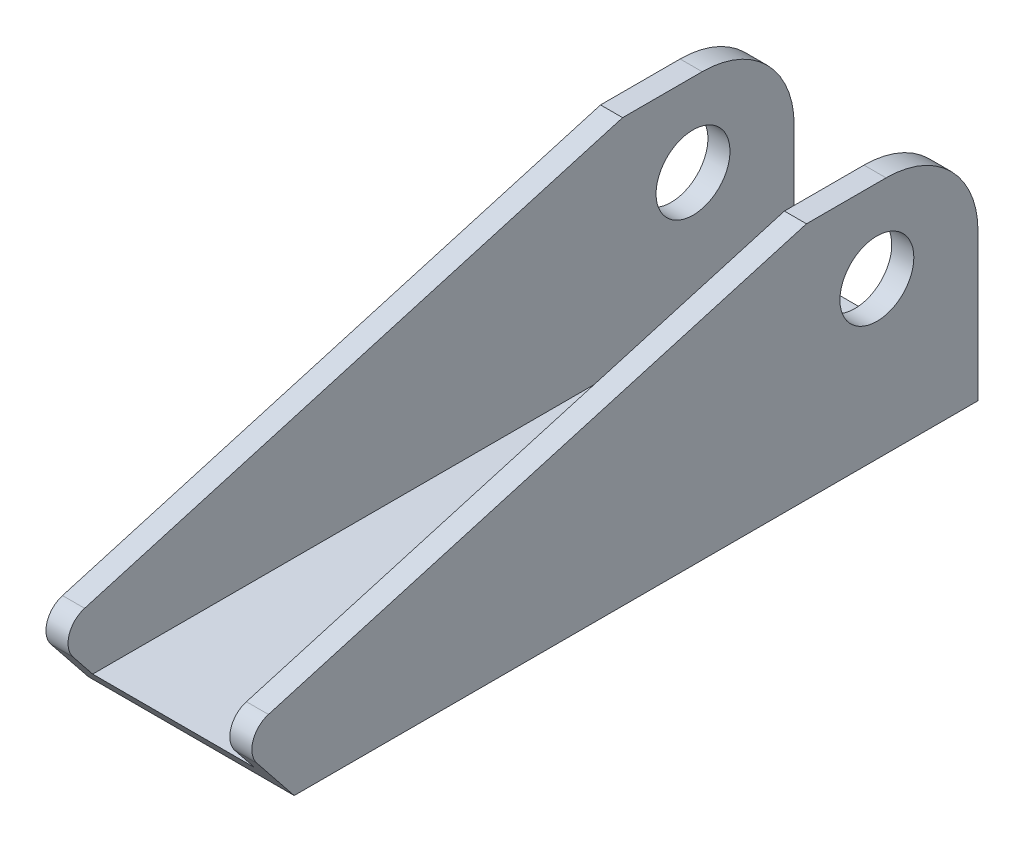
ISO-10303-21;
HEADER;
FILE_DESCRIPTION(('STEP AP214'),'2;1');
FILE_NAME('part.step','',(''),(''),'','','');
FILE_SCHEMA(('AUTOMOTIVE_DESIGN { 1 0 10303 214 1 1 1 1 }'));
ENDSEC;
DATA;
#1=APPLICATION_CONTEXT('core data for automotive mechanical design processes');
#2=APPLICATION_PROTOCOL_DEFINITION('international standard','automotive_design',2000,#1);
#3=PRODUCT_CONTEXT('',#1,'mechanical');
#4=PRODUCT('Part','Part','',(#3));
#5=PRODUCT_RELATED_PRODUCT_CATEGORY('part','',(#4));
#6=PRODUCT_DEFINITION_FORMATION('','',#4);
#7=PRODUCT_DEFINITION_CONTEXT('part definition',#1,'design');
#8=PRODUCT_DEFINITION('design','',#6,#7);
#9=PRODUCT_DEFINITION_SHAPE('','',#8);
#10=(LENGTH_UNIT() NAMED_UNIT(*) SI_UNIT(.MILLI.,.METRE.));
#11=(NAMED_UNIT(*) PLANE_ANGLE_UNIT() SI_UNIT($,.RADIAN.));
#12=(NAMED_UNIT(*) SI_UNIT($,.STERADIAN.) SOLID_ANGLE_UNIT());
#13=UNCERTAINTY_MEASURE_WITH_UNIT(LENGTH_MEASURE(1.E-05),#10,'distance_accuracy_value','');
#14=(GEOMETRIC_REPRESENTATION_CONTEXT(3) GLOBAL_UNCERTAINTY_ASSIGNED_CONTEXT((#13)) GLOBAL_UNIT_ASSIGNED_CONTEXT((#10,
#11,#12)) REPRESENTATION_CONTEXT('',''));
#15=CARTESIAN_POINT('',(0.,0.,0.));
#16=DIRECTION('',(0.,0.,1.));
#17=DIRECTION('',(1.,0.,0.));
#18=AXIS2_PLACEMENT_3D('',#15,#16,#17);
#19=CARTESIAN_POINT('',(1.524,16.51,57.15));
#20=DIRECTION('',(0.,-1.,0.));
#21=DIRECTION('',(0.,0.,-1.));
#22=AXIS2_PLACEMENT_3D('',#19,#20,#21);
#23=PLANE('',#22);
#24=DIRECTION('',(0.,0.,-1.));
#25=VECTOR('',#24,1.);
#26=CARTESIAN_POINT('',(0.,16.51,57.15));
#27=LINE('',#26,#25);
#28=CARTESIAN_POINT('',(0.,16.51,11.847593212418));
#29=VERTEX_POINT('',#28);
#30=CARTESIAN_POINT('',(0.,16.51,6.35));
#31=VERTEX_POINT('',#30);
#32=EDGE_CURVE('E166',#29,#31,#27,.T.);
#33=ORIENTED_EDGE('',*,*,#32,.F.);
#34=DIRECTION('',(-1.,0.,0.));
#35=VECTOR('',#34,1.);
#36=CARTESIAN_POINT('',(14.224,16.51,11.847593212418));
#37=LINE('',#36,#35);
#38=CARTESIAN_POINT('',(1.524,16.51,11.847593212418));
#39=VERTEX_POINT('',#38);
#40=EDGE_CURVE('E141',#39,#29,#37,.T.);
#41=ORIENTED_EDGE('',*,*,#40,.F.);
#42=DIRECTION('',(0.,0.,-1.));
#43=VECTOR('',#42,1.);
#44=CARTESIAN_POINT('',(1.524,16.51,57.15));
#45=LINE('',#44,#43);
#46=CARTESIAN_POINT('',(1.524,16.51,6.35));
#47=VERTEX_POINT('',#46);
#48=EDGE_CURVE('E265',#39,#47,#45,.T.);
#49=ORIENTED_EDGE('',*,*,#48,.T.);
#50=DIRECTION('',(-1.,0.,0.));
#51=VECTOR('',#50,1.);
#52=CARTESIAN_POINT('',(0.,16.51,6.35));
#53=LINE('',#52,#51);
#54=EDGE_CURVE('E182',#47,#31,#53,.T.);
#55=ORIENTED_EDGE('',*,*,#54,.T.);
#56=EDGE_LOOP('',(#33,#41,#49,#55));
#57=FACE_BOUND('',#56,.T.);
#58=ADVANCED_FACE('F36',(#57),#23,.F.);
#59=CARTESIAN_POINT('',(0.,16.51,57.15));
#60=DIRECTION('',(1.,0.,0.));
#61=DIRECTION('',(0.,1.,0.));
#62=AXIS2_PLACEMENT_3D('',#59,#60,#61);
#63=PLANE('',#62);
#64=CARTESIAN_POINT('',(0.,10.795,6.985));
#65=DIRECTION('',(-1.,0.,0.));
#66=DIRECTION('',(0.,0.,1.));
#67=AXIS2_PLACEMENT_3D('',#64,#65,#66);
#68=CIRCLE('',#67,2.5527);
#69=CARTESIAN_POINT('',(0.,10.795,9.5377));
#70=VERTEX_POINT('',#69);
#71=EDGE_CURVE('E173',#70,#70,#68,.T.);
#72=ORIENTED_EDGE('',*,*,#71,.F.);
#73=EDGE_LOOP('',(#72));
#74=FACE_BOUND('',#73,.T.);
#75=DIRECTION('',(0.,-0.781381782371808,-0.624053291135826));
#76=VECTOR('',#75,1.);
#77=CARTESIAN_POINT('',(0.,5.08,51.2884615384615));
#78=LINE('',#77,#76);
#79=CARTESIAN_POINT('',(0.,3.225258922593,49.8071660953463));
#80=VERTEX_POINT('',#79);
#81=CARTESIAN_POINT('',(0.,0.,47.2313017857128));
#82=VERTEX_POINT('',#81);
#83=EDGE_CURVE('E210',#80,#82,#78,.T.);
#84=ORIENTED_EDGE('',*,*,#83,.F.);
#85=CARTESIAN_POINT('',(0.,4.21594352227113,48.566722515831));
#86=DIRECTION('',(1.,0.,0.));
#87=DIRECTION('',(0.,1.,0.));
#88=AXIS2_PLACEMENT_3D('',#85,#86,#87);
#89=CIRCLE('',#88,1.5875);
#90=CARTESIAN_POINT('',(0.,5.74070595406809,49.0086000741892));
#91=VERTEX_POINT('',#90);
#92=EDGE_CURVE('E200',#80,#91,#89,.F.);
#93=ORIENTED_EDGE('',*,*,#92,.T.);
#94=DIRECTION('',(0.,-0.278348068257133,0.960480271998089));
#95=VECTOR('',#94,1.);
#96=CARTESIAN_POINT('',(0.,5.08,51.2884615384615));
#97=LINE('',#96,#95);
#98=EDGE_CURVE('E142',#29,#91,#97,.T.);
#99=ORIENTED_EDGE('',*,*,#98,.F.);
#100=ORIENTED_EDGE('',*,*,#32,.T.);
#101=CARTESIAN_POINT('',(0.,10.16,6.35));
#102=DIRECTION('',(1.,0.,0.));
#103=DIRECTION('',(0.,1.,0.));
#104=AXIS2_PLACEMENT_3D('',#101,#102,#103);
#105=CIRCLE('',#104,6.35);
#106=CARTESIAN_POINT('',(0.,10.16,0.));
#107=VERTEX_POINT('',#106);
#108=EDGE_CURVE('E185',#31,#107,#105,.F.);
#109=ORIENTED_EDGE('',*,*,#108,.T.);
#110=DIRECTION('',(0.,-1.,0.));
#111=VECTOR('',#110,1.);
#112=CARTESIAN_POINT('',(0.,16.51,0.));
#113=LINE('',#112,#111);
#114=CARTESIAN_POINT('',(0.,0.,0.));
#115=VERTEX_POINT('',#114);
#116=EDGE_CURVE('E248',#107,#115,#113,.T.);
#117=ORIENTED_EDGE('',*,*,#116,.T.);
#118=DIRECTION('',(0.,0.,-1.));
#119=VECTOR('',#118,1.);
#120=CARTESIAN_POINT('',(0.,0.,57.15));
#121=LINE('',#120,#119);
#122=EDGE_CURVE('E159',#82,#115,#121,.T.);
#123=ORIENTED_EDGE('',*,*,#122,.F.);
#124=EDGE_LOOP('',(#84,#93,#99,#100,#109,#117,#123));
#125=FACE_BOUND('',#124,.T.);
#126=ADVANCED_FACE('F207',(#74,#125),#63,.F.);
#127=CARTESIAN_POINT('',(0.,0.,57.15));
#128=DIRECTION('',(0.,1.,0.));
#129=DIRECTION('',(0.,0.,1.));
#130=AXIS2_PLACEMENT_3D('',#127,#128,#129);
#131=PLANE('',#130);
#132=DIRECTION('',(0.,0.,-1.));
#133=VECTOR('',#132,1.);
#134=CARTESIAN_POINT('',(14.224,0.,57.15));
#135=LINE('',#134,#133);
#136=CARTESIAN_POINT('',(14.224,0.,47.2313017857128));
#137=VERTEX_POINT('',#136);
#138=CARTESIAN_POINT('',(14.224,0.,0.));
#139=VERTEX_POINT('',#138);
#140=EDGE_CURVE('E157',#137,#139,#135,.T.);
#141=ORIENTED_EDGE('',*,*,#140,.F.);
#142=DIRECTION('',(-1.,0.,0.));
#143=VECTOR('',#142,1.);
#144=CARTESIAN_POINT('',(14.224,0.,47.2313017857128));
#145=LINE('',#144,#143);
#146=EDGE_CURVE('E231',#137,#82,#145,.T.);
#147=ORIENTED_EDGE('',*,*,#146,.T.);
#148=ORIENTED_EDGE('',*,*,#122,.T.);
#149=DIRECTION('',(1.,0.,0.));
#150=VECTOR('',#149,1.);
#151=CARTESIAN_POINT('',(0.,0.,0.));
#152=LINE('',#151,#150);
#153=EDGE_CURVE('E251',#115,#139,#152,.T.);
#154=ORIENTED_EDGE('',*,*,#153,.T.);
#155=EDGE_LOOP('',(#141,#147,#148,#154));
#156=FACE_BOUND('',#155,.T.);
#157=ADVANCED_FACE('F295',(#156),#131,.F.);
#158=CARTESIAN_POINT('',(14.224,0.,57.15));
#159=DIRECTION('',(-1.,0.,0.));
#160=DIRECTION('',(0.,-1.,0.));
#161=AXIS2_PLACEMENT_3D('',#158,#159,#160);
#162=PLANE('',#161);
#163=CARTESIAN_POINT('',(14.224,10.795,6.985));
#164=DIRECTION('',(-1.,0.,0.));
#165=DIRECTION('',(0.,-1.,0.));
#166=AXIS2_PLACEMENT_3D('',#163,#164,#165);
#167=CIRCLE('',#166,2.5527);
#168=CARTESIAN_POINT('',(14.224,8.2423,6.985));
#169=VERTEX_POINT('',#168);
#170=EDGE_CURVE('E245',#169,#169,#167,.T.);
#171=ORIENTED_EDGE('',*,*,#170,.T.);
#172=EDGE_LOOP('',(#171));
#173=FACE_BOUND('',#172,.T.);
#174=DIRECTION('',(0.,-0.278348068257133,0.960480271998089));
#175=VECTOR('',#174,1.);
#176=CARTESIAN_POINT('',(14.224,5.08,51.2884615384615));
#177=LINE('',#176,#175);
#178=CARTESIAN_POINT('',(14.224,16.51,11.847593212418));
#179=VERTEX_POINT('',#178);
#180=CARTESIAN_POINT('',(14.224,5.74070595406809,49.0086000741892));
#181=VERTEX_POINT('',#180);
#182=EDGE_CURVE('E133',#179,#181,#177,.T.);
#183=ORIENTED_EDGE('',*,*,#182,.T.);
#184=CARTESIAN_POINT('',(14.224,4.21594352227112,48.566722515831));
#185=DIRECTION('',(-1.,0.,0.));
#186=DIRECTION('',(0.,-1.,0.));
#187=AXIS2_PLACEMENT_3D('',#184,#185,#186);
#188=CIRCLE('',#187,1.5875);
#189=CARTESIAN_POINT('',(14.224,3.225258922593,49.8071660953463));
#190=VERTEX_POINT('',#189);
#191=EDGE_CURVE('E11',#181,#190,#188,.F.);
#192=ORIENTED_EDGE('',*,*,#191,.T.);
#193=DIRECTION('',(0.,-0.781381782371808,-0.624053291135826));
#194=VECTOR('',#193,1.);
#195=CARTESIAN_POINT('',(14.224,5.08,51.2884615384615));
#196=LINE('',#195,#194);
#197=EDGE_CURVE('E236',#190,#137,#196,.T.);
#198=ORIENTED_EDGE('',*,*,#197,.T.);
#199=ORIENTED_EDGE('',*,*,#140,.T.);
#200=DIRECTION('',(0.,1.,0.));
#201=VECTOR('',#200,1.);
#202=CARTESIAN_POINT('',(14.224,0.,0.));
#203=LINE('',#202,#201);
#204=CARTESIAN_POINT('',(14.224,10.16,0.));
#205=VERTEX_POINT('',#204);
#206=EDGE_CURVE('E254',#139,#205,#203,.T.);
#207=ORIENTED_EDGE('',*,*,#206,.T.);
#208=CARTESIAN_POINT('',(14.224,10.16,6.35));
#209=DIRECTION('',(-1.,0.,0.));
#210=DIRECTION('',(0.,-1.,0.));
#211=AXIS2_PLACEMENT_3D('',#208,#209,#210);
#212=CIRCLE('',#211,6.35);
#213=CARTESIAN_POINT('',(14.224,16.51,6.35));
#214=VERTEX_POINT('',#213);
#215=EDGE_CURVE('E155',#205,#214,#212,.F.);
#216=ORIENTED_EDGE('',*,*,#215,.T.);
#217=DIRECTION('',(0.,0.,-1.));
#218=VECTOR('',#217,1.);
#219=CARTESIAN_POINT('',(14.224,16.51,57.15));
#220=LINE('',#219,#218);
#221=EDGE_CURVE('E147',#179,#214,#220,.T.);
#222=ORIENTED_EDGE('',*,*,#221,.F.);
#223=EDGE_LOOP('',(#183,#192,#198,#199,#207,#216,#222));
#224=FACE_BOUND('',#223,.T.);
#225=ADVANCED_FACE('F152',(#173,#224),#162,.F.);
#226=CARTESIAN_POINT('',(14.224,16.51,57.15));
#227=DIRECTION('',(0.,-1.,0.));
#228=DIRECTION('',(1.,0.,0.));
#229=AXIS2_PLACEMENT_3D('',#226,#227,#228);
#230=PLANE('',#229);
#231=DIRECTION('',(0.,0.,-1.));
#232=VECTOR('',#231,1.);
#233=CARTESIAN_POINT('',(12.7,16.51,57.15));
#234=LINE('',#233,#232);
#235=CARTESIAN_POINT('',(12.7,16.51,11.847593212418));
#236=VERTEX_POINT('',#235);
#237=CARTESIAN_POINT('',(12.7,16.51,6.35));
#238=VERTEX_POINT('',#237);
#239=EDGE_CURVE('E149',#236,#238,#234,.T.);
#240=ORIENTED_EDGE('',*,*,#239,.F.);
#241=EDGE_CURVE('E136',#179,#236,#37,.T.);
#242=ORIENTED_EDGE('',*,*,#241,.F.);
#243=ORIENTED_EDGE('',*,*,#221,.T.);
#244=DIRECTION('',(-1.,0.,0.));
#245=VECTOR('',#244,1.);
#246=CARTESIAN_POINT('',(12.7,16.51,6.35));
#247=LINE('',#246,#245);
#248=EDGE_CURVE('E168',#214,#238,#247,.T.);
#249=ORIENTED_EDGE('',*,*,#248,.T.);
#250=EDGE_LOOP('',(#240,#242,#243,#249));
#251=FACE_BOUND('',#250,.T.);
#252=ADVANCED_FACE('F145',(#251),#230,.F.);
#253=CARTESIAN_POINT('',(12.7,16.51,57.15));
#254=DIRECTION('',(1.,0.,0.));
#255=DIRECTION('',(0.,1.,0.));
#256=AXIS2_PLACEMENT_3D('',#253,#254,#255);
#257=PLANE('',#256);
#258=CARTESIAN_POINT('',(12.7,10.795,6.985));
#259=DIRECTION('',(1.,0.,0.));
#260=DIRECTION('',(0.,1.,0.));
#261=AXIS2_PLACEMENT_3D('',#258,#259,#260);
#262=CIRCLE('',#261,2.5527);
#263=CARTESIAN_POINT('',(12.7,13.3477,6.985));
#264=VERTEX_POINT('',#263);
#265=EDGE_CURVE('E172',#264,#264,#262,.T.);
#266=ORIENTED_EDGE('',*,*,#265,.T.);
#267=EDGE_LOOP('',(#266));
#268=FACE_BOUND('',#267,.T.);
#269=DIRECTION('',(0.,0.781381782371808,0.624053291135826));
#270=VECTOR('',#269,1.);
#271=CARTESIAN_POINT('',(12.7,14.9168981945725,59.1447346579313));
#272=LINE('',#271,#270);
#273=CARTESIAN_POINT('',(12.7,1.524,48.4484497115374));
#274=VERTEX_POINT('',#273);
#275=CARTESIAN_POINT('',(12.7,3.225258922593,49.8071660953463));
#276=VERTEX_POINT('',#275);
#277=EDGE_CURVE('E233',#274,#276,#272,.T.);
#278=ORIENTED_EDGE('',*,*,#277,.T.);
#279=CARTESIAN_POINT('',(12.7,4.21594352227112,48.566722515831));
#280=DIRECTION('',(1.,0.,0.));
#281=DIRECTION('',(0.,1.,0.));
#282=AXIS2_PLACEMENT_3D('',#279,#280,#281);
#283=CIRCLE('',#282,1.5875);
#284=CARTESIAN_POINT('',(12.7,5.74070595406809,49.0086000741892));
#285=VERTEX_POINT('',#284);
#286=EDGE_CURVE('E58',#276,#285,#283,.F.);
#287=ORIENTED_EDGE('',*,*,#286,.T.);
#288=DIRECTION('',(0.,0.278348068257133,-0.960480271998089));
#289=VECTOR('',#288,1.);
#290=CARTESIAN_POINT('',(12.7,4.39849992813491,53.6400761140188));
#291=LINE('',#290,#289);
#292=EDGE_CURVE('E289',#285,#236,#291,.T.);
#293=ORIENTED_EDGE('',*,*,#292,.T.);
#294=ORIENTED_EDGE('',*,*,#239,.T.);
#295=CARTESIAN_POINT('',(12.7,10.16,6.35));
#296=DIRECTION('',(1.,0.,0.));
#297=DIRECTION('',(0.,1.,0.));
#298=AXIS2_PLACEMENT_3D('',#295,#296,#297);
#299=CIRCLE('',#298,6.35);
#300=CARTESIAN_POINT('',(12.7,10.16,0.));
#301=VERTEX_POINT('',#300);
#302=EDGE_CURVE('E175',#238,#301,#299,.F.);
#303=ORIENTED_EDGE('',*,*,#302,.T.);
#304=DIRECTION('',(0.,-1.,0.));
#305=VECTOR('',#304,1.);
#306=CARTESIAN_POINT('',(12.7,16.51,0.));
#307=LINE('',#306,#305);
#308=CARTESIAN_POINT('',(12.7,1.524,0.));
#309=VERTEX_POINT('',#308);
#310=EDGE_CURVE('E256',#301,#309,#307,.T.);
#311=ORIENTED_EDGE('',*,*,#310,.T.);
#312=DIRECTION('',(0.,0.,-1.));
#313=VECTOR('',#312,1.);
#314=CARTESIAN_POINT('',(12.7,1.524,57.15));
#315=LINE('',#314,#313);
#316=EDGE_CURVE('E161',#274,#309,#315,.T.);
#317=ORIENTED_EDGE('',*,*,#316,.F.);
#318=EDGE_LOOP('',(#278,#287,#293,#294,#303,#311,#317));
#319=FACE_BOUND('',#318,.T.);
#320=ADVANCED_FACE('F274',(#268,#319),#257,.F.);
#321=CARTESIAN_POINT('',(12.7,1.524,57.15));
#322=DIRECTION('',(0.,-1.,0.));
#323=DIRECTION('',(1.,0.,0.));
#324=AXIS2_PLACEMENT_3D('',#321,#322,#323);
#325=PLANE('',#324);
#326=DIRECTION('',(0.,0.,-1.));
#327=VECTOR('',#326,1.);
#328=CARTESIAN_POINT('',(1.524,1.52399999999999,57.15));
#329=LINE('',#328,#327);
#330=CARTESIAN_POINT('',(1.524,1.52399999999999,48.4484497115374));
#331=VERTEX_POINT('',#330);
#332=CARTESIAN_POINT('',(1.524,1.52399999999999,0.));
#333=VERTEX_POINT('',#332);
#334=EDGE_CURVE('E267',#331,#333,#329,.T.);
#335=ORIENTED_EDGE('',*,*,#334,.F.);
#336=DIRECTION('',(1.,0.,0.));
#337=VECTOR('',#336,1.);
#338=CARTESIAN_POINT('',(12.7,1.524,48.4484497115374));
#339=LINE('',#338,#337);
#340=EDGE_CURVE('E229',#331,#274,#339,.T.);
#341=ORIENTED_EDGE('',*,*,#340,.T.);
#342=ORIENTED_EDGE('',*,*,#316,.T.);
#343=DIRECTION('',(-1.,0.,0.));
#344=VECTOR('',#343,1.);
#345=CARTESIAN_POINT('',(12.7,1.524,0.));
#346=LINE('',#345,#344);
#347=EDGE_CURVE('E259',#309,#333,#346,.T.);
#348=ORIENTED_EDGE('',*,*,#347,.T.);
#349=EDGE_LOOP('',(#335,#341,#342,#348));
#350=FACE_BOUND('',#349,.T.);
#351=ADVANCED_FACE('F270',(#350),#325,.F.);
#352=CARTESIAN_POINT('',(1.524,1.52399999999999,57.15));
#353=DIRECTION('',(-1.,0.,0.));
#354=DIRECTION('',(0.,0.,1.));
#355=AXIS2_PLACEMENT_3D('',#352,#353,#354);
#356=PLANE('',#355);
#357=CARTESIAN_POINT('',(1.524,10.795,6.985));
#358=DIRECTION('',(-1.,0.,0.));
#359=DIRECTION('',(0.,0.,1.));
#360=AXIS2_PLACEMENT_3D('',#357,#358,#359);
#361=CIRCLE('',#360,2.5527);
#362=CARTESIAN_POINT('',(1.524,10.795,9.5377));
#363=VERTEX_POINT('',#362);
#364=EDGE_CURVE('E169',#363,#363,#361,.T.);
#365=ORIENTED_EDGE('',*,*,#364,.T.);
#366=EDGE_LOOP('',(#365));
#367=FACE_BOUND('',#366,.T.);
#368=DIRECTION('',(0.,-0.278348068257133,0.960480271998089));
#369=VECTOR('',#368,1.);
#370=CARTESIAN_POINT('',(1.524,3.23741990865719,57.6465506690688));
#371=LINE('',#370,#369);
#372=CARTESIAN_POINT('',(1.524,5.74070595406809,49.0086000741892));
#373=VERTEX_POINT('',#372);
#374=EDGE_CURVE('E150',#39,#373,#371,.T.);
#375=ORIENTED_EDGE('',*,*,#374,.T.);
#376=CARTESIAN_POINT('',(1.524,4.21594352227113,48.566722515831));
#377=DIRECTION('',(-1.,0.,0.));
#378=DIRECTION('',(0.,0.,1.));
#379=AXIS2_PLACEMENT_3D('',#376,#377,#378);
#380=CIRCLE('',#379,1.5875);
#381=CARTESIAN_POINT('',(1.524,3.225258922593,49.8071660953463));
#382=VERTEX_POINT('',#381);
#383=EDGE_CURVE('E193',#373,#382,#380,.F.);
#384=ORIENTED_EDGE('',*,*,#383,.T.);
#385=DIRECTION('',(0.,-0.781381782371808,-0.624053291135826));
#386=VECTOR('',#385,1.);
#387=CARTESIAN_POINT('',(1.524,5.76708365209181,51.8372032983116));
#388=LINE('',#387,#386);
#389=EDGE_CURVE('E223',#382,#331,#388,.T.);
#390=ORIENTED_EDGE('',*,*,#389,.T.);
#391=ORIENTED_EDGE('',*,*,#334,.T.);
#392=DIRECTION('',(0.,1.,0.));
#393=VECTOR('',#392,1.);
#394=CARTESIAN_POINT('',(1.524,1.52399999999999,0.));
#395=LINE('',#394,#393);
#396=CARTESIAN_POINT('',(1.524,10.16,0.));
#397=VERTEX_POINT('',#396);
#398=EDGE_CURVE('E262',#333,#397,#395,.T.);
#399=ORIENTED_EDGE('',*,*,#398,.T.);
#400=CARTESIAN_POINT('',(1.524,10.16,6.35));
#401=DIRECTION('',(-1.,0.,0.));
#402=DIRECTION('',(0.,0.,1.));
#403=AXIS2_PLACEMENT_3D('',#400,#401,#402);
#404=CIRCLE('',#403,6.35);
#405=EDGE_CURVE('E187',#397,#47,#404,.F.);
#406=ORIENTED_EDGE('',*,*,#405,.T.);
#407=ORIENTED_EDGE('',*,*,#48,.F.);
#408=EDGE_LOOP('',(#375,#384,#390,#391,#399,#406,#407));
#409=FACE_BOUND('',#408,.T.);
#410=ADVANCED_FACE('F222',(#367,#409),#356,.F.);
#411=CARTESIAN_POINT('',(1.524,16.51,0.));
#412=DIRECTION('',(0.,0.,-1.));
#413=DIRECTION('',(-1.,0.,0.));
#414=AXIS2_PLACEMENT_3D('',#411,#412,#413);
#415=PLANE('',#414);
#416=ORIENTED_EDGE('',*,*,#310,.F.);
#417=DIRECTION('',(-1.,0.,0.));
#418=VECTOR('',#417,1.);
#419=CARTESIAN_POINT('',(14.224,10.16,0.));
#420=LINE('',#419,#418);
#421=EDGE_CURVE('E179',#301,#205,#420,.F.);
#422=ORIENTED_EDGE('',*,*,#421,.T.);
#423=ORIENTED_EDGE('',*,*,#206,.F.);
#424=ORIENTED_EDGE('',*,*,#153,.F.);
#425=ORIENTED_EDGE('',*,*,#116,.F.);
#426=DIRECTION('',(-1.,0.,0.));
#427=VECTOR('',#426,1.);
#428=CARTESIAN_POINT('',(1.524,10.16,0.));
#429=LINE('',#428,#427);
#430=EDGE_CURVE('E177',#107,#397,#429,.F.);
#431=ORIENTED_EDGE('',*,*,#430,.T.);
#432=ORIENTED_EDGE('',*,*,#398,.F.);
#433=ORIENTED_EDGE('',*,*,#347,.F.);
#434=EDGE_LOOP('',(#416,#422,#423,#424,#425,#431,#432,#433));
#435=FACE_BOUND('',#434,.T.);
#436=ADVANCED_FACE('F278',(#435),#415,.T.);
#437=CARTESIAN_POINT('',(0.,10.795,6.985));
#438=DIRECTION('',(-1.,0.,0.));
#439=DIRECTION('',(0.,0.,1.));
#440=AXIS2_PLACEMENT_3D('',#437,#438,#439);
#441=CYLINDRICAL_SURFACE('',#440,2.5527);
#442=ORIENTED_EDGE('',*,*,#71,.T.);
#443=EDGE_LOOP('',(#442));
#444=FACE_BOUND('',#443,.T.);
#445=ORIENTED_EDGE('',*,*,#364,.F.);
#446=EDGE_LOOP('',(#445));
#447=FACE_BOUND('',#446,.T.);
#448=ADVANCED_FACE('F308',(#444,#447),#441,.F.);
#449=ORIENTED_EDGE('',*,*,#265,.F.);
#450=EDGE_LOOP('',(#449));
#451=FACE_BOUND('',#450,.T.);
#452=ORIENTED_EDGE('',*,*,#170,.F.);
#453=EDGE_LOOP('',(#452));
#454=FACE_BOUND('',#453,.T.);
#455=ADVANCED_FACE('F301',(#451,#454),#441,.F.);
#456=CARTESIAN_POINT('',(14.224,10.16,6.35));
#457=DIRECTION('',(1.,0.,0.));
#458=DIRECTION('',(0.,1.,0.));
#459=AXIS2_PLACEMENT_3D('',#456,#457,#458);
#460=CYLINDRICAL_SURFACE('',#459,6.35);
#461=ORIENTED_EDGE('',*,*,#215,.F.);
#462=ORIENTED_EDGE('',*,*,#421,.F.);
#463=ORIENTED_EDGE('',*,*,#302,.F.);
#464=ORIENTED_EDGE('',*,*,#248,.F.);
#465=EDGE_LOOP('',(#461,#462,#463,#464));
#466=FACE_BOUND('',#465,.T.);
#467=ADVANCED_FACE('F299',(#466),#460,.T.);
#468=CARTESIAN_POINT('',(1.524,10.16,6.35));
#469=DIRECTION('',(1.,0.,0.));
#470=DIRECTION('',(0.,0.,-1.));
#471=AXIS2_PLACEMENT_3D('',#468,#469,#470);
#472=CYLINDRICAL_SURFACE('',#471,6.35);
#473=ORIENTED_EDGE('',*,*,#405,.F.);
#474=ORIENTED_EDGE('',*,*,#430,.F.);
#475=ORIENTED_EDGE('',*,*,#108,.F.);
#476=ORIENTED_EDGE('',*,*,#54,.F.);
#477=EDGE_LOOP('',(#473,#474,#475,#476));
#478=FACE_BOUND('',#477,.T.);
#479=ADVANCED_FACE('F284',(#478),#472,.T.);
#480=CARTESIAN_POINT('',(14.224,5.08,51.2884615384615));
#481=DIRECTION('',(0.,0.624053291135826,-0.781381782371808));
#482=DIRECTION('',(0.,0.781381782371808,0.624053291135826));
#483=AXIS2_PLACEMENT_3D('',#480,#481,#482);
#484=PLANE('',#483);
#485=ORIENTED_EDGE('',*,*,#389,.F.);
#486=DIRECTION('',(1.,0.,0.));
#487=VECTOR('',#486,1.);
#488=CARTESIAN_POINT('',(14.224,3.225258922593,49.8071660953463));
#489=LINE('',#488,#487);
#490=EDGE_CURVE('E198',#382,#80,#489,.F.);
#491=ORIENTED_EDGE('',*,*,#490,.T.);
#492=ORIENTED_EDGE('',*,*,#83,.T.);
#493=ORIENTED_EDGE('',*,*,#146,.F.);
#494=ORIENTED_EDGE('',*,*,#197,.F.);
#495=DIRECTION('',(-1.,0.,0.));
#496=VECTOR('',#495,1.);
#497=CARTESIAN_POINT('',(14.224,3.225258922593,49.8071660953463));
#498=LINE('',#497,#496);
#499=EDGE_CURVE('E195',#190,#276,#498,.T.);
#500=ORIENTED_EDGE('',*,*,#499,.T.);
#501=ORIENTED_EDGE('',*,*,#277,.F.);
#502=ORIENTED_EDGE('',*,*,#340,.F.);
#503=EDGE_LOOP('',(#485,#491,#492,#493,#494,#500,#501,#502));
#504=FACE_BOUND('',#503,.T.);
#505=ADVANCED_FACE('F227',(#504),#484,.F.);
#506=CARTESIAN_POINT('',(14.224,5.08,51.2884615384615));
#507=DIRECTION('',(0.,-0.960480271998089,-0.278348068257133));
#508=DIRECTION('',(0.,0.278348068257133,-0.960480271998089));
#509=AXIS2_PLACEMENT_3D('',#506,#507,#508);
#510=PLANE('',#509);
#511=ORIENTED_EDGE('',*,*,#98,.T.);
#512=DIRECTION('',(1.,0.,0.));
#513=VECTOR('',#512,1.);
#514=CARTESIAN_POINT('',(14.224,5.74070595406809,49.0086000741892));
#515=LINE('',#514,#513);
#516=EDGE_CURVE('E190',#91,#373,#515,.T.);
#517=ORIENTED_EDGE('',*,*,#516,.T.);
#518=ORIENTED_EDGE('',*,*,#374,.F.);
#519=ORIENTED_EDGE('',*,*,#40,.T.);
#520=EDGE_LOOP('',(#511,#517,#518,#519));
#521=FACE_BOUND('',#520,.T.);
#522=ADVANCED_FACE('F215',(#521),#510,.F.);
#523=ORIENTED_EDGE('',*,*,#292,.F.);
#524=DIRECTION('',(-1.,0.,0.));
#525=VECTOR('',#524,1.);
#526=CARTESIAN_POINT('',(14.224,5.74070595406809,49.0086000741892));
#527=LINE('',#526,#525);
#528=EDGE_CURVE('E44',#285,#181,#527,.F.);
#529=ORIENTED_EDGE('',*,*,#528,.T.);
#530=ORIENTED_EDGE('',*,*,#182,.F.);
#531=ORIENTED_EDGE('',*,*,#241,.T.);
#532=EDGE_LOOP('',(#523,#529,#530,#531));
#533=FACE_BOUND('',#532,.T.);
#534=ADVANCED_FACE('F135',(#533),#510,.F.);
#535=CARTESIAN_POINT('',(14.224,4.21594352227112,48.566722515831));
#536=DIRECTION('',(1.,0.,0.));
#537=DIRECTION('',(0.,1.,0.));
#538=AXIS2_PLACEMENT_3D('',#535,#536,#537);
#539=CYLINDRICAL_SURFACE('',#538,1.5875);
#540=ORIENTED_EDGE('',*,*,#92,.F.);
#541=ORIENTED_EDGE('',*,*,#490,.F.);
#542=ORIENTED_EDGE('',*,*,#383,.F.);
#543=ORIENTED_EDGE('',*,*,#516,.F.);
#544=EDGE_LOOP('',(#540,#541,#542,#543));
#545=FACE_BOUND('',#544,.T.);
#546=ADVANCED_FACE('F219',(#545),#539,.T.);
#547=CARTESIAN_POINT('',(14.224,4.21594352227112,48.566722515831));
#548=DIRECTION('',(-1.,0.,0.));
#549=DIRECTION('',(0.,-1.,0.));
#550=AXIS2_PLACEMENT_3D('',#547,#548,#549);
#551=CYLINDRICAL_SURFACE('',#550,1.5875);
#552=ORIENTED_EDGE('',*,*,#191,.F.);
#553=ORIENTED_EDGE('',*,*,#528,.F.);
#554=ORIENTED_EDGE('',*,*,#286,.F.);
#555=ORIENTED_EDGE('',*,*,#499,.F.);
#556=EDGE_LOOP('',(#552,#553,#554,#555));
#557=FACE_BOUND('',#556,.T.);
#558=ADVANCED_FACE('F38',(#557),#551,.T.);
#559=CLOSED_SHELL('',(#58,#126,#157,#225,#252,#320,#351,#410,#436,#448,#455,#467,#479,#505,#522,
#534,#546,#558));
#560=MANIFOLD_SOLID_BREP('B2',#559);
#561=ADVANCED_BREP_SHAPE_REPRESENTATION('',(#18,#560),#14);
#562=SHAPE_DEFINITION_REPRESENTATION(#9,#561);
ENDSEC;
END-ISO-10303-21;
